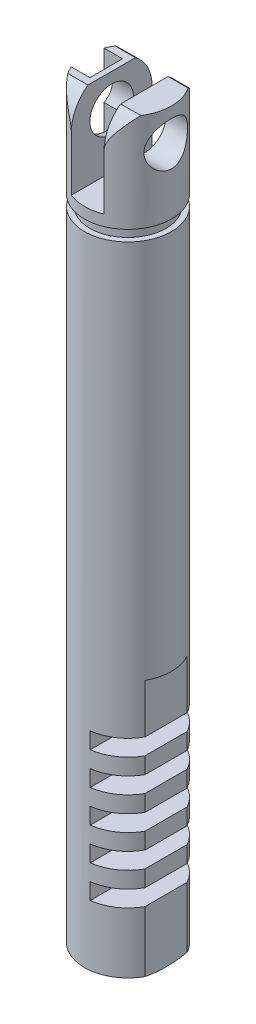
from build123d import *

# Parameters (mm, degrees)
SKETCH1_R               = 4
BOSS_EXTRUDE1_DEPTH     = 70
SKETCH6_W               = 4.328496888
SKETCH6_H               = 9.579040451
CUT_EXTRUDE1_DEPTH      = 25
SKETCH9_W               = 3.5
SKETCH9_H               = 1.5
CUT_EXTRUDE3_DEPTH      = 71.228199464
LPATTERN1_COUNT         = 5
LPATTERN1_PITCH         = 3
SKETCH11_R              = 5.104330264
SKETCH11_R_2            = 3.5
CUT_EXTRUDE4_DEPTH      = 1
SKETCH13_W              = 3.424884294
SKETCH13_H              = 3
CUT_EXTRUDE5_DEPTH      = 30
SKETCH16_W              = 3
SKETCH16_H              = 11.255026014
CUT_EXTRUDE6_DEPTH      = 8
CUT_EXTRUDE7_DEPTH      = 71.370448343
CUT_EXTRUDE7_DEPTH_BACK = 71.370448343
SKETCH17_R              = 2
CUT_EXTRUDE8_DEPTH      = 71.228199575
CUT_EXTRUDE8_DEPTH_BACK = 71.228199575


with BuildPart() as part:
    # Sketch1 → Boss-Extrude1 (new body)
    with BuildSketch(Plane(origin=(0, 0, 0), x_dir=(1, 0, 0), z_dir=(0, 1, 0))):
        with Locations(Location((0, 0, 0), (0, 0, 270))):
            Circle(SKETCH1_R)
    extrude(amount=BOSS_EXTRUDE1_DEPTH)

    # Sketch6 → Cut-Extrude1 (cut)
    with BuildSketch(Plane.XZ):
        with Locations((5.664248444, 0.051224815)):
            Rectangle(SKETCH6_W, SKETCH6_H)
    extrude(amount=-CUT_EXTRUDE1_DEPTH, mode=Mode.SUBTRACT)

    # Sketch9 → Cut-Extrude3 (cut, symmetric)
    with BuildSketch(Plane.XY):
        with Locations((2.25, 7.75)):
            Rectangle(SKETCH9_W, SKETCH9_H)
    cut_extrude3 = extrude(amount=CUT_EXTRUDE3_DEPTH, both=True, mode=Mode.SUBTRACT)

    # LPattern1: Cut-Extrude3 ×5
    with Locations(*[(0, i * LPATTERN1_PITCH, 0) for i in range(1, LPATTERN1_COUNT)]):
        add(cut_extrude3, mode=Mode.SUBTRACT)

    # Sketch11 → Cut-Extrude4 (cut)
    with BuildSketch(Plane.XZ.offset(-60)):
        Circle(SKETCH11_R)
        with Locations(Location((0, 0, 0), (0, 0, 270))):
            Circle(SKETCH11_R_2, mode=Mode.SUBTRACT)
    extrude(amount=-CUT_EXTRUDE4_DEPTH, mode=Mode.SUBTRACT)

    # Sketch12 → Cut-Revolve4 (revolve, cut)
    with BuildSketch(Plane.XY, mode=Mode.PRIVATE) as cut_revolve4_sk:
        Polygon((-4, 1.426267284), (-4, 0), (-0.375954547, 0), align=None)
    revolve(cut_revolve4_sk.sketch.rotate(Axis((0, 60, 0), (0, -1, 0)), 90), axis=Axis((0, 60, 0), (0, -1, 0)), mode=Mode.SUBTRACT)

    # Sketch13 → Cut-Extrude5 (cut)
    with BuildSketch(Plane(origin=(0, 70, 0), x_dir=(1, 0, 0), z_dir=(0, 1, 0))):
        with Locations((-3.712442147, 0)):
            Rectangle(SKETCH13_W, SKETCH13_H)
    extrude(amount=-CUT_EXTRUDE5_DEPTH, mode=Mode.SUBTRACT)

    # Sketch16 → Cut-Extrude6 (cut)
    with BuildSketch(Plane(origin=(0, 70, 0), x_dir=(1, 0, 0), z_dir=(0, 1, 0))):
        Rectangle(SKETCH16_W, SKETCH16_H)
    extrude(amount=-CUT_EXTRUDE6_DEPTH, mode=Mode.SUBTRACT)

    # Sketch17 → Cut-Extrude7 (cut, two sides: drawn at the far end of the back side and taken through both)
    with BuildSketch(Plane.ZY.offset(2).offset(-CUT_EXTRUDE7_DEPTH_BACK)):
        with Locations((0, 67)):
            Circle(SKETCH17_R)
    extrude(amount=CUT_EXTRUDE7_DEPTH + CUT_EXTRUDE7_DEPTH_BACK, mode=Mode.SUBTRACT)

    # Sketch18 → Cut-Extrude8 (cut, two sides: drawn at the far end of the back side and taken through both)
    with BuildSketch(Plane(origin=(0, 0, 0), x_dir=(0, 0, -1), z_dir=(1, 0, 0)).offset(-CUT_EXTRUDE8_DEPTH_BACK)):
        with BuildLine():
            Line((3.708099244, 67), (5.27482694, 67))
            ThreePointArc((5.27482694, 67), (-0.019969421, 72.27478914), (-5.27467574, 66.960061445))
            Line((-5.27467574, 66.960061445), (-3.708099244, 67))
            ThreePointArc((-3.708099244, 67), (0, 70.708099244), (3.708099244, 67))
        make_face()
    extrude(amount=CUT_EXTRUDE8_DEPTH + CUT_EXTRUDE8_DEPTH_BACK, mode=Mode.SUBTRACT)


solid = part.part
